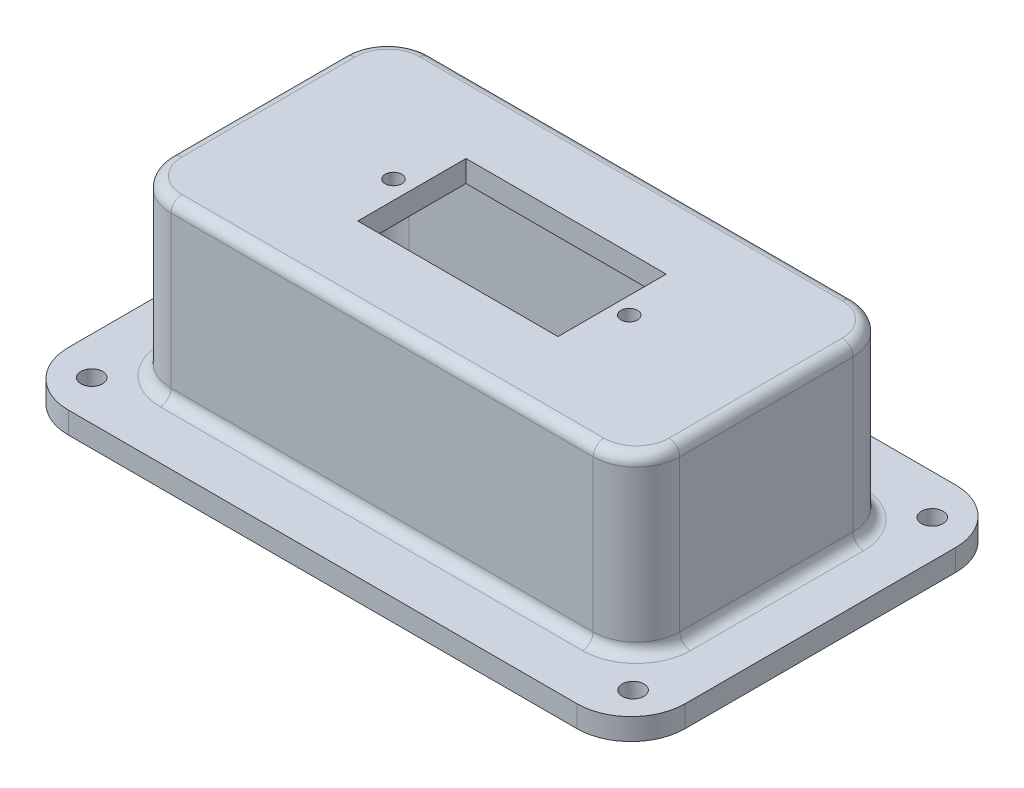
from build123d import *

# Parameters (mm, degrees)
BOSS_EXTRUDE1_DEPTH = 2.54
BOSS_EXTRUDE2_DEPTH = 17.78
BOSS_EXTRUDE3_DEPTH = 2.54
SKETCH4_W           = 23.495
SKETCH4_H           = 12.7
CUT_EXTRUDE1_DEPTH  = 49.234927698
FILLET1_R           = 1.27
SKETCH5_R           = 0.975
CUT_EXTRUDE2_DEPTH  = 49.234927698
SKETCH6_W           = 12.7
SKETCH6_H           = 2.54
CUT_EXTRUDE3_DEPTH  = 2.54
SKETCH7_R           = 1.27
CUT_EXTRUDE4_DEPTH  = 2.54


with BuildPart() as part:
    # Sketch1 → Boss-Extrude1 (new body)
    with BuildSketch(Plane(origin=(0, 0, 0), x_dir=(1, 0, 0), z_dir=(0, 1, 0))):
        with BuildLine():
            Line((-29.845, 22.225), (29.845, 22.225))
            ThreePointArc((29.845, 22.225), (34.335128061, 20.365128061), (36.195, 15.875))
            Line((36.195, 15.875), (36.195, -15.875))
            ThreePointArc((36.195, -15.875), (34.335128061, -20.365128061), (29.845, -22.225))
            Line((29.845, -22.225), (-29.845, -22.225))
            ThreePointArc((-29.845, -22.225), (-34.335128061, -20.365128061), (-36.195, -15.875))
            Line((-36.195, -15.875), (-36.195, 15.875))
            ThreePointArc((-36.195, 15.875), (-34.335128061, 20.365128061), (-29.845, 22.225))
        make_face()
        with BuildLine():
            Line((-24.765, 12.7), (24.765, 12.7))
            ThreePointArc((24.765, 12.7), (26.561051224, 11.956051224), (27.305, 10.16))
            Line((27.305, 10.16), (27.305, -10.16))
            ThreePointArc((27.305, -10.16), (26.561051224, -11.956051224), (24.765, -12.7))
            Line((24.765, -12.7), (-24.765, -12.7))
            ThreePointArc((-24.765, -12.7), (-26.561051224, -11.956051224), (-27.305, -10.16))
            Line((-27.305, -10.16), (-27.305, 10.16))
            ThreePointArc((-27.305, 10.16), (-26.561051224, 11.956051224), (-24.765, 12.7))
        make_face(mode=Mode.SUBTRACT)
    extrude(amount=BOSS_EXTRUDE1_DEPTH)

    # Sketch2 → Boss-Extrude2 (add)
    with BuildSketch(Plane(origin=(0, 2.54, 0), x_dir=(1, 0, 0), z_dir=(0, 1, 0))):
        with BuildLine():
            Line((-29.845, 10.16), (-29.845, -10.16))
            ThreePointArc((-29.845, -10.16), (-28.357102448, -13.752102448), (-24.765, -15.24))
            Line((-24.765, -15.24), (24.765, -15.24))
            ThreePointArc((24.765, -15.24), (28.357102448, -13.752102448), (29.845, -10.16))
            Line((29.845, -10.16), (29.845, 10.16))
            ThreePointArc((29.845, 10.16), (28.357102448, 13.752102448), (24.765, 15.24))
            Line((24.765, 15.24), (-24.765, 15.24))
            ThreePointArc((-24.765, 15.24), (-28.357102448, 13.752102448), (-29.845, 10.16))
        make_face()
        with BuildLine():
            Line((-24.765, -12.7), (24.765, -12.7))
            ThreePointArc((24.765, -12.7), (26.561051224, -11.956051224), (27.305, -10.16))
            Line((27.305, -10.16), (27.305, 10.16))
            ThreePointArc((27.305, 10.16), (26.561051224, 11.956051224), (24.765, 12.7))
            Line((24.765, 12.7), (-24.765, 12.7))
            ThreePointArc((-24.765, 12.7), (-26.561051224, 11.956051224), (-27.305, 10.16))
            Line((-27.305, 10.16), (-27.305, -10.16))
            ThreePointArc((-27.305, -10.16), (-26.561051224, -11.956051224), (-24.765, -12.7))
        make_face(mode=Mode.SUBTRACT)
    extrude(amount=BOSS_EXTRUDE2_DEPTH)

    # Sketch3 → Boss-Extrude3 (add)
    with BuildSketch(Plane(origin=(0, 20.32, 0), x_dir=(1, 0, 0), z_dir=(0, 1, 0))):
        with BuildLine():
            Line((-29.845, 10.16), (-29.845, -10.16))
            ThreePointArc((-29.845, -10.16), (-28.357102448, -13.752102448), (-24.765, -15.24))
            Line((-24.765, -15.24), (24.765, -15.24))
            ThreePointArc((24.765, -15.24), (28.357102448, -13.752102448), (29.845, -10.16))
            Line((29.845, -10.16), (29.845, 10.16))
            ThreePointArc((29.845, 10.16), (28.357102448, 13.752102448), (24.765, 15.24))
            Line((24.765, 15.24), (-24.765, 15.24))
            ThreePointArc((-24.765, 15.24), (-28.357102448, 13.752102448), (-29.845, 10.16))
        make_face()
    extrude(amount=BOSS_EXTRUDE3_DEPTH)

    # Sketch4 → Cut-Extrude1 (cut, through all)
    with BuildSketch(Plane(origin=(0, 22.86, 0), x_dir=(1, 0, 0), z_dir=(0, 1, 0))):
        Rectangle(SKETCH4_W, SKETCH4_H)
    extrude(amount=-CUT_EXTRUDE1_DEPTH, mode=Mode.SUBTRACT)

    # Fillet1
    fillet1_edges = [part.edges().sort_by_distance(p)[0] for p in [
        (28.357102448, 22.86, 13.752102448),
        (29.845, 22.86, 0),
        (28.357102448, 22.86, -13.752102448),
        (0, 22.86, -15.24),
        (-28.357102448, 2.54, -13.752102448),
        (-29.845, 2.54, 0),
        (-28.357102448, 2.54, 13.752102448),
        (0, 2.54, 15.24),
        (28.357102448, 2.54, 13.752102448),
        (29.845, 2.54, 0),
        (28.357102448, 2.54, -13.752102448),
        (0, 2.54, -15.24),
        (-28.357102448, 22.86, -13.752102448),
        (-29.845, 22.86, 0),
        (-28.357102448, 22.86, 13.752102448),
        (0, 22.86, 15.24),
    ]]
    fillet(fillet1_edges, radius=FILLET1_R)

    # Sketch5 → Cut-Extrude2 (cut, through all)
    with BuildSketch(Plane(origin=(0, 22.86, 0), x_dir=(1, 0, 0), z_dir=(0, 1, 0))):
        with Locations(Location((-13.92, 0.011231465, 0), (0, 0, 270))):
            Circle(SKETCH5_R)
        with Locations(Location((13.75, 0.011231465, 0), (0, 0, 270))):
            Circle(SKETCH5_R)
    extrude(amount=-CUT_EXTRUDE2_DEPTH, mode=Mode.SUBTRACT)

    # Sketch6 → Cut-Extrude3 (cut)
    with BuildSketch(Plane.ZY.offset(29.845)):
        with Locations((0, 6.35)):
            Rectangle(SKETCH6_W, SKETCH6_H)
    extrude(amount=-CUT_EXTRUDE3_DEPTH, mode=Mode.SUBTRACT)

    # Sketch7 → Cut-Extrude4 (cut)
    with BuildSketch(Plane(origin=(0, 2.54, 0), x_dir=(1, 0, 0), z_dir=(0, 1, 0))):
        with Locations(Location((-31.762463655, -17.554879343, 0), (0, 0, 270))):
            Circle(SKETCH7_R)
        with Locations(Location((-31.762463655, 17.554879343, 0), (0, 0, 90))):
            Circle(SKETCH7_R)
        with Locations(Location((31.762463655, 17.554879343, 0), (0, 0, 270))):
            Circle(SKETCH7_R)
        with Locations(Location((31.762463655, -17.554879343, 0), (0, 0, 90))):
            Circle(SKETCH7_R)
    extrude(amount=-CUT_EXTRUDE4_DEPTH, mode=Mode.SUBTRACT)


solid = part.part
